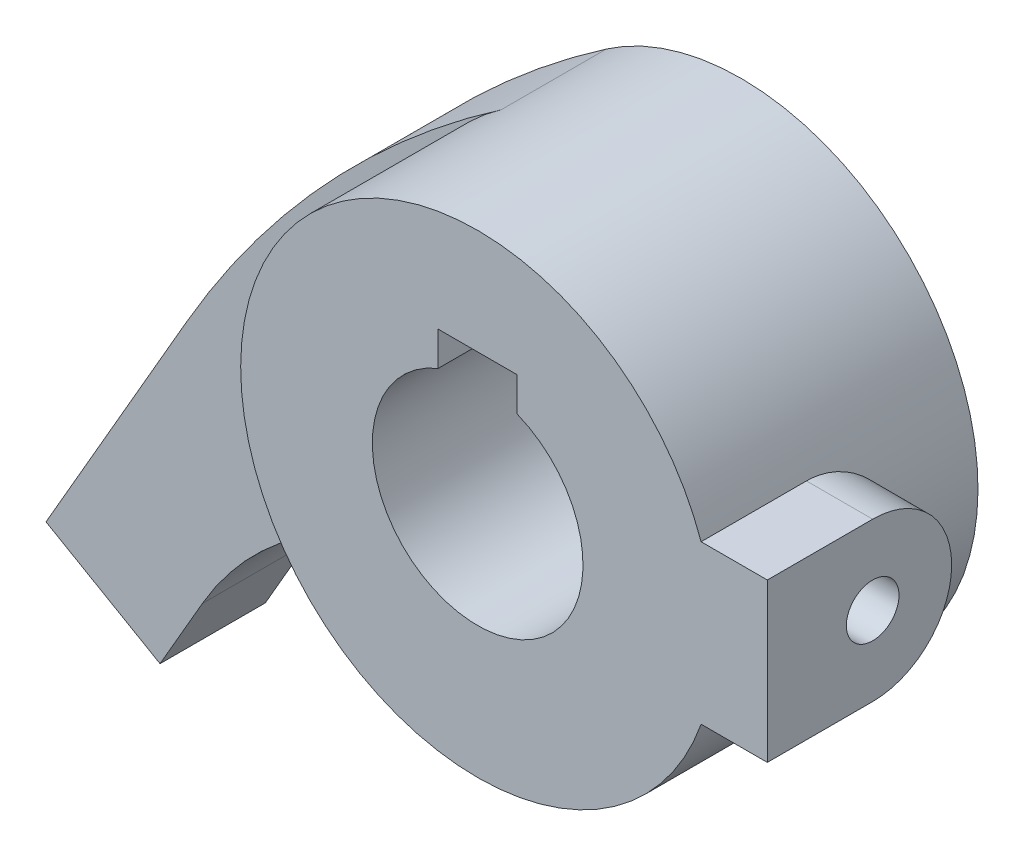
from build123d import *

# Parameters (mm, degrees)
SKETCH_1_R           = 18
EXTRUDE_1_DEPTH      = 20
EXTRUDE_2_REACH      = 50.208
EXTRUDE_2_END_RADIUS = 18
SKETCH_2_R           = 2
EXTRUDE_3_DEPTH      = 8


with BuildPart() as part:
    # Sketch 1 → Extrude 1 (new body)
    with BuildSketch(Plane.XY):
        Circle(SKETCH_1_R)
        with BuildLine():
            Line((-3, 7.416198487), (-3, 10))
            Line((-3, 10), (3, 10))
            Line((3, 10), (3, 7.416198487))
            ThreePointArc((3, 7.416198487), (0, -8), (-3, 7.416198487))
        make_face(mode=Mode.SUBTRACT)
    extrude(amount=EXTRUDE_1_DEPTH)

    # Extrude 2: up to this cylinder (the profile starts outside it)
    extrude_2_end = Plane(origin=(0, 0, 6.184391), z_dir=(0, 0, -1)) * Cylinder(EXTRUDE_2_END_RADIUS, 137.416, mode=Mode.PRIVATE)
    # Sketch 2 → Extrude 2 (add, up to the surface)
    with BuildSketch(Plane(origin=(22, 0, 0), x_dir=(0, 0, -1), z_dir=(1, 0, 0)), mode=Mode.PRIVATE) as extrude_2_sk1:
        with BuildLine():
            Line((-12, 6), (-20, 6))
            Line((-20, 6), (-20, -6))
            Line((-20, -6), (-12, -6))
            ThreePointArc((-12, -6), (-6, 0), (-12, 6))
        make_face()
        with Locations((-12, 0)):
            Circle(SKETCH_2_R, mode=Mode.SUBTRACT)
    extrude_2_tool1 = extrude(extrude_2_sk1.sketch, amount=-EXTRUDE_2_REACH, mode=Mode.PRIVATE) - extrude_2_end
    add(extrude_2_tool1.solids().sort_by_distance((22, 0, 6.184391))[0])

    # Sketch 3 → Extrude 3 (add)
    with BuildSketch(Plane.XY):
        with BuildLine():
            Line((-34.088744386, -11.043437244), (-44.784609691, -29.569219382))
            Line((-44.784609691, -29.569219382), (-36.124355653, -34.569219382))
            Line((-36.124355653, -34.569219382), (-32.908965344, -29))
            ThreePointArc((-32.908965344, -29), (-20.789490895, -18.388163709), (-4.712789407, -17.372093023))
            ThreePointArc((-4.712789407, -17.372093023), (-17.742471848, -3.033923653), (-10.217406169, 14.819062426))
            ThreePointArc((-10.217406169, 14.819062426), (-23.592957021, 3.216837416), (-34.088744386, -11.043437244))
        make_face()
    extrude(amount=EXTRUDE_3_DEPTH)


solid = part.part
